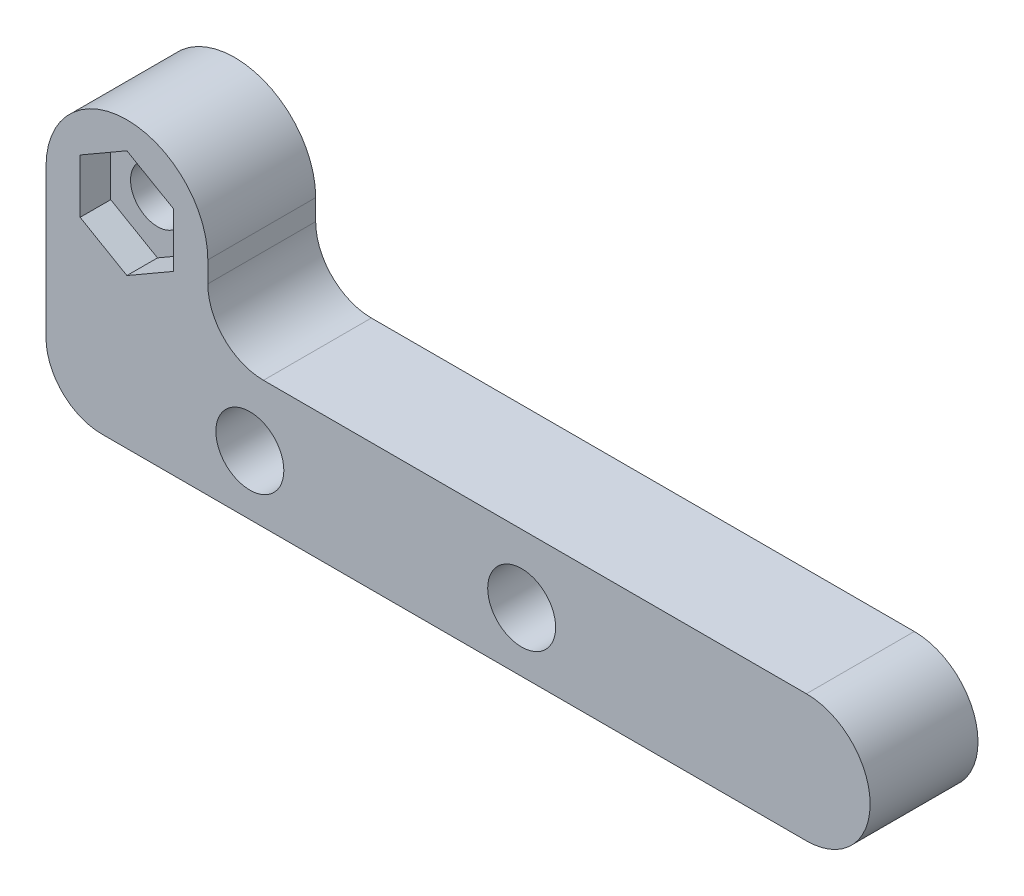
ISO-10303-21;
HEADER;
FILE_DESCRIPTION(('STEP AP214'),'2;1');
FILE_NAME('part.step','',(''),(''),'','','');
FILE_SCHEMA(('AUTOMOTIVE_DESIGN { 1 0 10303 214 1 1 1 1 }'));
ENDSEC;
DATA;
#1=APPLICATION_CONTEXT('core data for automotive mechanical design processes');
#2=APPLICATION_PROTOCOL_DEFINITION('international standard','automotive_design',2000,#1);
#3=PRODUCT_CONTEXT('',#1,'mechanical');
#4=PRODUCT('Part','Part','',(#3));
#5=PRODUCT_RELATED_PRODUCT_CATEGORY('part','',(#4));
#6=PRODUCT_DEFINITION_FORMATION('','',#4);
#7=PRODUCT_DEFINITION_CONTEXT('part definition',#1,'design');
#8=PRODUCT_DEFINITION('design','',#6,#7);
#9=PRODUCT_DEFINITION_SHAPE('','',#8);
#10=(LENGTH_UNIT() NAMED_UNIT(*) SI_UNIT(.MILLI.,.METRE.));
#11=(NAMED_UNIT(*) PLANE_ANGLE_UNIT() SI_UNIT($,.RADIAN.));
#12=(NAMED_UNIT(*) SI_UNIT($,.STERADIAN.) SOLID_ANGLE_UNIT());
#13=UNCERTAINTY_MEASURE_WITH_UNIT(LENGTH_MEASURE(1.E-05),#10,'distance_accuracy_value','');
#14=(GEOMETRIC_REPRESENTATION_CONTEXT(3) GLOBAL_UNCERTAINTY_ASSIGNED_CONTEXT((#13)) GLOBAL_UNIT_ASSIGNED_CONTEXT((#10,
#11,#12)) REPRESENTATION_CONTEXT('',''));
#15=CARTESIAN_POINT('',(0.,0.,0.));
#16=DIRECTION('',(0.,0.,1.));
#17=DIRECTION('',(1.,0.,0.));
#18=AXIS2_PLACEMENT_3D('',#15,#16,#17);
#19=CARTESIAN_POINT('',(0.,0.,6.35));
#20=DIRECTION('',(0.,0.,1.));
#21=DIRECTION('',(1.,0.,0.));
#22=AXIS2_PLACEMENT_3D('',#19,#20,#21);
#23=PLANE('',#22);
#24=CARTESIAN_POINT('',(-3.78399987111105,-8.5,6.35));
#25=DIRECTION('',(0.,0.,1.));
#26=DIRECTION('',(1.,0.,0.));
#27=AXIS2_PLACEMENT_3D('',#24,#25,#26);
#28=CIRCLE('',#27,2.);
#29=CARTESIAN_POINT('',(-1.78399987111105,-8.5,6.35));
#30=VERTEX_POINT('',#29);
#31=EDGE_CURVE('E565',#30,#30,#28,.F.);
#32=ORIENTED_EDGE('',*,*,#31,.T.);
#33=EDGE_LOOP('',(#32));
#34=FACE_BOUND('',#33,.T.);
#35=DIRECTION('',(0.,-1.,0.));
#36=VECTOR('',#35,1.);
#37=CARTESIAN_POINT('',(-13.7754606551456,1.59,6.35));
#38=LINE('',#37,#36);
#39=CARTESIAN_POINT('',(-13.7754606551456,1.59,6.35));
#40=VERTEX_POINT('',#39);
#41=CARTESIAN_POINT('',(-13.7754606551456,-1.59,6.35));
#42=VERTEX_POINT('',#41);
#43=EDGE_CURVE('E59',#40,#42,#38,.T.);
#44=ORIENTED_EDGE('',*,*,#43,.F.);
#45=DIRECTION('',(-0.866025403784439,-0.5,0.));
#46=VECTOR('',#45,1.);
#47=CARTESIAN_POINT('',(-11.021499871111,3.18,6.35));
#48=LINE('',#47,#46);
#49=CARTESIAN_POINT('',(-11.021499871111,3.18,6.35));
#50=VERTEX_POINT('',#49);
#51=EDGE_CURVE('E178',#50,#40,#48,.T.);
#52=ORIENTED_EDGE('',*,*,#51,.F.);
#53=DIRECTION('',(-0.866025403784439,0.5,0.));
#54=VECTOR('',#53,1.);
#55=CARTESIAN_POINT('',(-8.26753908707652,1.59,6.35));
#56=LINE('',#55,#54);
#57=CARTESIAN_POINT('',(-8.26753908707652,1.59,6.35));
#58=VERTEX_POINT('',#57);
#59=EDGE_CURVE('E181',#58,#50,#56,.T.);
#60=ORIENTED_EDGE('',*,*,#59,.F.);
#61=DIRECTION('',(0.,1.,0.));
#62=VECTOR('',#61,1.);
#63=CARTESIAN_POINT('',(-8.26753908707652,-1.59,6.35));
#64=LINE('',#63,#62);
#65=CARTESIAN_POINT('',(-8.26753908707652,-1.59,6.35));
#66=VERTEX_POINT('',#65);
#67=EDGE_CURVE('E200',#66,#58,#64,.T.);
#68=ORIENTED_EDGE('',*,*,#67,.F.);
#69=DIRECTION('',(0.866025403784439,0.5,0.));
#70=VECTOR('',#69,1.);
#71=CARTESIAN_POINT('',(-11.021499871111,-3.18,6.35));
#72=LINE('',#71,#70);
#73=CARTESIAN_POINT('',(-11.021499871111,-3.18,6.35));
#74=VERTEX_POINT('',#73);
#75=EDGE_CURVE('E197',#74,#66,#72,.T.);
#76=ORIENTED_EDGE('',*,*,#75,.F.);
#77=DIRECTION('',(0.866025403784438,-0.5,0.));
#78=VECTOR('',#77,1.);
#79=CARTESIAN_POINT('',(-13.7754606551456,-1.59,6.35));
#80=LINE('',#79,#78);
#81=EDGE_CURVE('E195',#42,#74,#80,.T.);
#82=ORIENTED_EDGE('',*,*,#81,.F.);
#83=EDGE_LOOP('',(#44,#52,#60,#68,#76,#82));
#84=FACE_BOUND('',#83,.T.);
#85=DIRECTION('',(0.,-1.,0.));
#86=VECTOR('',#85,1.);
#87=CARTESIAN_POINT('',(-15.7839998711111,0.,6.35));
#88=LINE('',#87,#86);
#89=CARTESIAN_POINT('',(-15.7839998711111,0.,6.35));
#90=VERTEX_POINT('',#89);
#91=CARTESIAN_POINT('',(-15.783999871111,-8.7234,6.35));
#92=VERTEX_POINT('',#91);
#93=EDGE_CURVE('E232',#90,#92,#88,.T.);
#94=ORIENTED_EDGE('',*,*,#93,.T.);
#95=CARTESIAN_POINT('',(-12.507399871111,-8.7234,6.35));
#96=DIRECTION('',(0.,0.,1.));
#97=DIRECTION('',(1.,0.,0.));
#98=AXIS2_PLACEMENT_3D('',#95,#96,#97);
#99=CIRCLE('',#98,3.2766);
#100=CARTESIAN_POINT('',(-12.507399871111,-12.,6.35));
#101=VERTEX_POINT('',#100);
#102=EDGE_CURVE('E381',#92,#101,#99,.T.);
#103=ORIENTED_EDGE('',*,*,#102,.T.);
#104=DIRECTION('',(-1.,0.,0.));
#105=VECTOR('',#104,1.);
#106=CARTESIAN_POINT('',(0.,-12.,6.35));
#107=LINE('',#106,#105);
#108=CARTESIAN_POINT('',(28.978500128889,-12.,6.35));
#109=VERTEX_POINT('',#108);
#110=EDGE_CURVE('E219',#109,#101,#107,.T.);
#111=ORIENTED_EDGE('',*,*,#110,.F.);
#112=CARTESIAN_POINT('',(28.978500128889,-8.25,6.35));
#113=DIRECTION('',(0.,0.,1.));
#114=DIRECTION('',(1.,0.,0.));
#115=AXIS2_PLACEMENT_3D('',#112,#113,#114);
#116=CIRCLE('',#115,3.74999999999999);
#117=CARTESIAN_POINT('',(28.978500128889,-4.5,6.35));
#118=VERTEX_POINT('',#117);
#119=EDGE_CURVE('E222',#109,#118,#116,.T.);
#120=ORIENTED_EDGE('',*,*,#119,.T.);
#121=DIRECTION('',(1.,0.,0.));
#122=VECTOR('',#121,1.);
#123=CARTESIAN_POINT('',(0.,-4.5,6.35));
#124=LINE('',#123,#122);
#125=CARTESIAN_POINT('',(-2.98239987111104,-4.5,6.35));
#126=VERTEX_POINT('',#125);
#127=EDGE_CURVE('E226',#126,#118,#124,.T.);
#128=ORIENTED_EDGE('',*,*,#127,.F.);
#129=CARTESIAN_POINT('',(-2.98239987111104,-1.2234,6.35));
#130=DIRECTION('',(0.,0.,1.));
#131=DIRECTION('',(1.,0.,0.));
#132=AXIS2_PLACEMENT_3D('',#129,#130,#131);
#133=CIRCLE('',#132,3.2766);
#134=CARTESIAN_POINT('',(-6.25899987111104,-1.2234,6.35));
#135=VERTEX_POINT('',#134);
#136=EDGE_CURVE('E11',#126,#135,#133,.F.);
#137=ORIENTED_EDGE('',*,*,#136,.T.);
#138=DIRECTION('',(0.,-1.,0.));
#139=VECTOR('',#138,1.);
#140=CARTESIAN_POINT('',(-6.25899987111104,0.,6.35));
#141=LINE('',#140,#139);
#142=CARTESIAN_POINT('',(-6.25899987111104,0.,6.35));
#143=VERTEX_POINT('',#142);
#144=EDGE_CURVE('E228',#143,#135,#141,.T.);
#145=ORIENTED_EDGE('',*,*,#144,.F.);
#146=CARTESIAN_POINT('',(-11.021499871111,0.,6.35));
#147=DIRECTION('',(0.,0.,1.));
#148=DIRECTION('',(1.,0.,0.));
#149=AXIS2_PLACEMENT_3D('',#146,#147,#148);
#150=CIRCLE('',#149,4.7625);
#151=EDGE_CURVE('E230',#143,#90,#150,.T.);
#152=ORIENTED_EDGE('',*,*,#151,.T.);
#153=EDGE_LOOP('',(#94,#103,#111,#120,#128,#137,#145,#152));
#154=FACE_BOUND('',#153,.T.);
#155=CARTESIAN_POINT('',(12.2160001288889,-8.5,6.35));
#156=DIRECTION('',(0.,0.,1.));
#157=DIRECTION('',(1.,0.,0.));
#158=AXIS2_PLACEMENT_3D('',#155,#156,#157);
#159=CIRCLE('',#158,2.);
#160=CARTESIAN_POINT('',(14.2160001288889,-8.5,6.35));
#161=VERTEX_POINT('',#160);
#162=EDGE_CURVE('E184',#161,#161,#159,.T.);
#163=ORIENTED_EDGE('',*,*,#162,.F.);
#164=EDGE_LOOP('',(#163));
#165=FACE_BOUND('',#164,.T.);
#166=ADVANCED_FACE('F43',(#34,#84,#154,#165),#23,.T.);
#167=CARTESIAN_POINT('',(0.,0.,0.));
#168=DIRECTION('',(0.,0.,1.));
#169=DIRECTION('',(1.,0.,0.));
#170=AXIS2_PLACEMENT_3D('',#167,#168,#169);
#171=PLANE('',#170);
#172=CARTESIAN_POINT('',(-11.021499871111,0.,0.));
#173=DIRECTION('',(0.,0.,1.));
#174=DIRECTION('',(1.,0.,0.));
#175=AXIS2_PLACEMENT_3D('',#172,#173,#174);
#176=CIRCLE('',#175,1.5875);
#177=CARTESIAN_POINT('',(-9.43399987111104,0.,0.));
#178=VERTEX_POINT('',#177);
#179=EDGE_CURVE('E223',#178,#178,#176,.T.);
#180=ORIENTED_EDGE('',*,*,#179,.T.);
#181=EDGE_LOOP('',(#180));
#182=FACE_BOUND('',#181,.T.);
#183=DIRECTION('',(-1.,0.,0.));
#184=VECTOR('',#183,1.);
#185=CARTESIAN_POINT('',(0.,-12.,0.));
#186=LINE('',#185,#184);
#187=CARTESIAN_POINT('',(28.978500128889,-12.,0.));
#188=VERTEX_POINT('',#187);
#189=CARTESIAN_POINT('',(-12.507399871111,-12.,0.));
#190=VERTEX_POINT('',#189);
#191=EDGE_CURVE('E217',#188,#190,#186,.T.);
#192=ORIENTED_EDGE('',*,*,#191,.T.);
#193=CARTESIAN_POINT('',(-12.507399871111,-8.7234,0.));
#194=DIRECTION('',(0.,0.,1.));
#195=DIRECTION('',(1.,0.,0.));
#196=AXIS2_PLACEMENT_3D('',#193,#194,#195);
#197=CIRCLE('',#196,3.2766);
#198=CARTESIAN_POINT('',(-15.783999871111,-8.7234,0.));
#199=VERTEX_POINT('',#198);
#200=EDGE_CURVE('E376',#190,#199,#197,.F.);
#201=ORIENTED_EDGE('',*,*,#200,.T.);
#202=DIRECTION('',(0.,-1.,0.));
#203=VECTOR('',#202,1.);
#204=CARTESIAN_POINT('',(-15.7839998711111,0.,0.));
#205=LINE('',#204,#203);
#206=CARTESIAN_POINT('',(-15.7839998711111,0.,0.));
#207=VERTEX_POINT('',#206);
#208=EDGE_CURVE('E249',#207,#199,#205,.T.);
#209=ORIENTED_EDGE('',*,*,#208,.F.);
#210=CARTESIAN_POINT('',(-11.021499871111,0.,0.));
#211=DIRECTION('',(0.,0.,1.));
#212=DIRECTION('',(1.,0.,0.));
#213=AXIS2_PLACEMENT_3D('',#210,#211,#212);
#214=CIRCLE('',#213,4.7625);
#215=CARTESIAN_POINT('',(-6.25899987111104,0.,0.));
#216=VERTEX_POINT('',#215);
#217=EDGE_CURVE('E246',#216,#207,#214,.T.);
#218=ORIENTED_EDGE('',*,*,#217,.F.);
#219=DIRECTION('',(0.,-1.,0.));
#220=VECTOR('',#219,1.);
#221=CARTESIAN_POINT('',(-6.25899987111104,0.,0.));
#222=LINE('',#221,#220);
#223=CARTESIAN_POINT('',(-6.25899987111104,-1.2234,0.));
#224=VERTEX_POINT('',#223);
#225=EDGE_CURVE('E243',#216,#224,#222,.T.);
#226=ORIENTED_EDGE('',*,*,#225,.T.);
#227=CARTESIAN_POINT('',(-2.98239987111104,-1.2234,0.));
#228=DIRECTION('',(0.,0.,1.));
#229=DIRECTION('',(1.,0.,0.));
#230=AXIS2_PLACEMENT_3D('',#227,#228,#229);
#231=CIRCLE('',#230,3.2766);
#232=CARTESIAN_POINT('',(-2.98239987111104,-4.5,0.));
#233=VERTEX_POINT('',#232);
#234=EDGE_CURVE('E52',#224,#233,#231,.T.);
#235=ORIENTED_EDGE('',*,*,#234,.T.);
#236=DIRECTION('',(1.,0.,0.));
#237=VECTOR('',#236,1.);
#238=CARTESIAN_POINT('',(0.,-4.5,0.));
#239=LINE('',#238,#237);
#240=CARTESIAN_POINT('',(28.978500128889,-4.5,0.));
#241=VERTEX_POINT('',#240);
#242=EDGE_CURVE('E241',#233,#241,#239,.T.);
#243=ORIENTED_EDGE('',*,*,#242,.T.);
#244=CARTESIAN_POINT('',(28.978500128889,-8.25,0.));
#245=DIRECTION('',(0.,0.,1.));
#246=DIRECTION('',(1.,0.,0.));
#247=AXIS2_PLACEMENT_3D('',#244,#245,#246);
#248=CIRCLE('',#247,3.74999999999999);
#249=EDGE_CURVE('E238',#188,#241,#248,.T.);
#250=ORIENTED_EDGE('',*,*,#249,.F.);
#251=EDGE_LOOP('',(#192,#201,#209,#218,#226,#235,#243,#250));
#252=FACE_BOUND('',#251,.T.);
#253=CARTESIAN_POINT('',(-3.78399987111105,-8.5,0.));
#254=DIRECTION('',(0.,0.,1.));
#255=DIRECTION('',(1.,0.,0.));
#256=AXIS2_PLACEMENT_3D('',#253,#254,#255);
#257=CIRCLE('',#256,2.);
#258=CARTESIAN_POINT('',(-1.78399987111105,-8.5,0.));
#259=VERTEX_POINT('',#258);
#260=EDGE_CURVE('E566',#259,#259,#257,.T.);
#261=ORIENTED_EDGE('',*,*,#260,.T.);
#262=EDGE_LOOP('',(#261));
#263=FACE_BOUND('',#262,.T.);
#264=CARTESIAN_POINT('',(12.2160001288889,-8.5,0.));
#265=DIRECTION('',(0.,0.,-1.));
#266=DIRECTION('',(-1.,0.,0.));
#267=AXIS2_PLACEMENT_3D('',#264,#265,#266);
#268=CIRCLE('',#267,2.);
#269=CARTESIAN_POINT('',(10.2160001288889,-8.5,0.));
#270=VERTEX_POINT('',#269);
#271=EDGE_CURVE('E563',#270,#270,#268,.T.);
#272=ORIENTED_EDGE('',*,*,#271,.F.);
#273=EDGE_LOOP('',(#272));
#274=FACE_BOUND('',#273,.T.);
#275=ADVANCED_FACE('F390',(#182,#252,#263,#274),#171,.F.);
#276=CARTESIAN_POINT('',(-11.021499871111,0.,6.35));
#277=DIRECTION('',(0.,0.,-1.));
#278=DIRECTION('',(-1.,0.,0.));
#279=AXIS2_PLACEMENT_3D('',#276,#277,#278);
#280=CYLINDRICAL_SURFACE('',#279,1.5875);
#281=ORIENTED_EDGE('',*,*,#179,.F.);
#282=EDGE_LOOP('',(#281));
#283=FACE_BOUND('',#282,.T.);
#284=CARTESIAN_POINT('',(-11.021499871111,0.,4.55));
#285=DIRECTION('',(0.,0.,1.));
#286=DIRECTION('',(1.,0.,0.));
#287=AXIS2_PLACEMENT_3D('',#284,#285,#286);
#288=CIRCLE('',#287,1.5875);
#289=CARTESIAN_POINT('',(-9.43399987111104,0.,4.55));
#290=VERTEX_POINT('',#289);
#291=EDGE_CURVE('E47',#290,#290,#288,.T.);
#292=ORIENTED_EDGE('',*,*,#291,.T.);
#293=EDGE_LOOP('',(#292));
#294=FACE_BOUND('',#293,.T.);
#295=ADVANCED_FACE('F305',(#283,#294),#280,.F.);
#296=CARTESIAN_POINT('',(0.,-12.,6.35));
#297=DIRECTION('',(0.,-1.,0.));
#298=DIRECTION('',(1.,0.,0.));
#299=AXIS2_PLACEMENT_3D('',#296,#297,#298);
#300=PLANE('',#299);
#301=ORIENTED_EDGE('',*,*,#110,.T.);
#302=DIRECTION('',(0.,0.,-1.));
#303=VECTOR('',#302,1.);
#304=CARTESIAN_POINT('',(-12.507399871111,-12.,0.));
#305=LINE('',#304,#303);
#306=EDGE_CURVE('E368',#101,#190,#305,.T.);
#307=ORIENTED_EDGE('',*,*,#306,.T.);
#308=ORIENTED_EDGE('',*,*,#191,.F.);
#309=DIRECTION('',(0.,0.,-1.));
#310=VECTOR('',#309,1.);
#311=CARTESIAN_POINT('',(28.978500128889,-12.,6.35));
#312=LINE('',#311,#310);
#313=EDGE_CURVE('E412',#109,#188,#312,.T.);
#314=ORIENTED_EDGE('',*,*,#313,.F.);
#315=EDGE_LOOP('',(#301,#307,#308,#314));
#316=FACE_BOUND('',#315,.T.);
#317=ADVANCED_FACE('F301',(#316),#300,.T.);
#318=CARTESIAN_POINT('',(28.978500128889,-8.25,6.35));
#319=DIRECTION('',(0.,0.,-1.));
#320=DIRECTION('',(-1.,0.,0.));
#321=AXIS2_PLACEMENT_3D('',#318,#319,#320);
#322=CYLINDRICAL_SURFACE('',#321,3.74999999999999);
#323=ORIENTED_EDGE('',*,*,#249,.T.);
#324=DIRECTION('',(0.,0.,-1.));
#325=VECTOR('',#324,1.);
#326=CARTESIAN_POINT('',(28.978500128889,-4.5,6.35));
#327=LINE('',#326,#325);
#328=EDGE_CURVE('E400',#118,#241,#327,.T.);
#329=ORIENTED_EDGE('',*,*,#328,.F.);
#330=ORIENTED_EDGE('',*,*,#119,.F.);
#331=ORIENTED_EDGE('',*,*,#313,.T.);
#332=EDGE_LOOP('',(#323,#329,#330,#331));
#333=FACE_BOUND('',#332,.T.);
#334=ADVANCED_FACE('F297',(#333),#322,.T.);
#335=CARTESIAN_POINT('',(0.,-4.5,6.35));
#336=DIRECTION('',(0.,1.,0.));
#337=DIRECTION('',(-1.,0.,0.));
#338=AXIS2_PLACEMENT_3D('',#335,#336,#337);
#339=PLANE('',#338);
#340=ORIENTED_EDGE('',*,*,#242,.F.);
#341=DIRECTION('',(0.,0.,-1.));
#342=VECTOR('',#341,1.);
#343=CARTESIAN_POINT('',(-2.98239987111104,-4.5,6.35));
#344=LINE('',#343,#342);
#345=EDGE_CURVE('E386',#233,#126,#344,.F.);
#346=ORIENTED_EDGE('',*,*,#345,.T.);
#347=ORIENTED_EDGE('',*,*,#127,.T.);
#348=ORIENTED_EDGE('',*,*,#328,.T.);
#349=EDGE_LOOP('',(#340,#346,#347,#348));
#350=FACE_BOUND('',#349,.T.);
#351=ADVANCED_FACE('F293',(#350),#339,.T.);
#352=CARTESIAN_POINT('',(-6.25899987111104,0.,6.35));
#353=DIRECTION('',(1.,0.,0.));
#354=DIRECTION('',(0.,1.,0.));
#355=AXIS2_PLACEMENT_3D('',#352,#353,#354);
#356=PLANE('',#355);
#357=ORIENTED_EDGE('',*,*,#144,.T.);
#358=DIRECTION('',(0.,0.,-1.));
#359=VECTOR('',#358,1.);
#360=CARTESIAN_POINT('',(-6.25899987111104,-1.2234,0.));
#361=LINE('',#360,#359);
#362=EDGE_CURVE('E383',#135,#224,#361,.T.);
#363=ORIENTED_EDGE('',*,*,#362,.T.);
#364=ORIENTED_EDGE('',*,*,#225,.F.);
#365=DIRECTION('',(0.,0.,-1.));
#366=VECTOR('',#365,1.);
#367=CARTESIAN_POINT('',(-6.25899987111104,0.,6.35));
#368=LINE('',#367,#366);
#369=EDGE_CURVE('E256',#143,#216,#368,.T.);
#370=ORIENTED_EDGE('',*,*,#369,.F.);
#371=EDGE_LOOP('',(#357,#363,#364,#370));
#372=FACE_BOUND('',#371,.T.);
#373=ADVANCED_FACE('F289',(#372),#356,.T.);
#374=CARTESIAN_POINT('',(-11.021499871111,0.,6.35));
#375=DIRECTION('',(0.,0.,-1.));
#376=DIRECTION('',(-1.,0.,0.));
#377=AXIS2_PLACEMENT_3D('',#374,#375,#376);
#378=CYLINDRICAL_SURFACE('',#377,4.7625);
#379=DIRECTION('',(0.,0.,-1.));
#380=VECTOR('',#379,1.);
#381=CARTESIAN_POINT('',(-15.7839998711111,0.,6.35));
#382=LINE('',#381,#380);
#383=CARTESIAN_POINT('',(-15.7839998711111,0.,1.71875000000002));
#384=VERTEX_POINT('',#383);
#385=EDGE_CURVE('E235',#384,#207,#382,.T.);
#386=ORIENTED_EDGE('',*,*,#385,.F.);
#387=CARTESIAN_POINT('',(-15.783999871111,0.,6.21874999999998));
#388=CARTESIAN_POINT('',(-15.7839994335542,0.0848417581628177,6.21874780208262));
#389=CARTESIAN_POINT('',(-15.7817347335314,0.169018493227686,6.21491617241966));
#390=CARTESIAN_POINT('',(-15.772862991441,0.336084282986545,6.19981840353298));
#391=CARTESIAN_POINT('',(-15.766250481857,0.418991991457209,6.18854437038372));
#392=CARTESIAN_POINT('',(-15.753201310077,0.542340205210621,6.16609126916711));
#393=CARTESIAN_POINT('',(-15.7483129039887,0.583380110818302,6.15765224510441));
#394=CARTESIAN_POINT('',(-15.7375510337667,0.66479487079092,6.1389777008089));
#395=CARTESIAN_POINT('',(-15.7317126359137,0.704920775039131,6.1288029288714));
#396=CARTESIAN_POINT('',(-15.7191609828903,0.784217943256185,6.10679521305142));
#397=CARTESIAN_POINT('',(-15.7124514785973,0.823361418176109,6.09496879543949));
#398=CARTESIAN_POINT('',(-15.6982233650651,0.900671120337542,6.06971147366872));
#399=CARTESIAN_POINT('',(-15.6907046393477,0.938837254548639,6.05628043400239));
#400=CARTESIAN_POINT('',(-15.6670170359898,1.05190741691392,6.01362009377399));
#401=CARTESIAN_POINT('',(-15.6497164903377,1.12538597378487,5.98202922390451));
#402=CARTESIAN_POINT('',(-15.612512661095,1.26865540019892,5.91259642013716));
#403=CARTESIAN_POINT('',(-15.5926213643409,1.33840292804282,5.87478111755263));
#404=CARTESIAN_POINT('',(-15.5505880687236,1.47439080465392,5.79263277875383));
#405=CARTESIAN_POINT('',(-15.5287918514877,1.53951187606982,5.74896555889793));
#406=CARTESIAN_POINT('',(-15.484311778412,1.66405820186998,5.656812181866));
#407=CARTESIAN_POINT('',(-15.4616072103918,1.72354285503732,5.60828877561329));
#408=CARTESIAN_POINT('',(-15.4158338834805,1.83711312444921,5.50633101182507));
#409=CARTESIAN_POINT('',(-15.3927556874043,1.89121250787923,5.45287596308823));
#410=CARTESIAN_POINT('',(-15.3583267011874,1.96828259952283,5.36891107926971));
#411=CARTESIAN_POINT('',(-15.3468673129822,1.99331986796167,5.34024795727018));
#412=CARTESIAN_POINT('',(-15.3241146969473,2.04196785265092,5.2816680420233));
#413=CARTESIAN_POINT('',(-15.3128917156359,2.0654299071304,5.25193241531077));
#414=CARTESIAN_POINT('',(-15.2798104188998,2.13324068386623,5.16140023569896));
#415=CARTESIAN_POINT('',(-15.2584902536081,2.17513501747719,5.09917754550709));
#416=CARTESIAN_POINT('',(-15.2180286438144,2.25220952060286,4.9710072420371));
#417=CARTESIAN_POINT('',(-15.1988717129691,2.28742009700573,4.90501128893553));
#418=CARTESIAN_POINT('',(-15.1722996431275,2.33508030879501,4.80305948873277));
#419=CARTESIAN_POINT('',(-15.1637929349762,2.35012336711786,4.76851911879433));
#420=CARTESIAN_POINT('',(-15.1476263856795,2.37839253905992,4.69851244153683));
#421=CARTESIAN_POINT('',(-15.1400266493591,2.3915144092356,4.6633047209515));
#422=CARTESIAN_POINT('',(-15.1258317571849,2.41579464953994,4.59237312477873));
#423=CARTESIAN_POINT('',(-15.1192406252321,2.42694600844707,4.55666662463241));
#424=CARTESIAN_POINT('',(-15.1071323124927,2.44727476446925,4.484766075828));
#425=CARTESIAN_POINT('',(-15.1016151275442,2.45645213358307,4.44857202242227));
#426=CARTESIAN_POINT('',(-15.0867660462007,2.48100450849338,4.33924486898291));
#427=CARTESIAN_POINT('',(-15.0791399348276,2.4934032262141,4.26535513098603));
#428=CARTESIAN_POINT('',(-15.0727400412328,2.50377014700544,4.17171748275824));
#429=CARTESIAN_POINT('',(-15.0716185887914,2.5055833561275,4.15291290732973));
#430=CARTESIAN_POINT('',(-15.0696961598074,2.50868818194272,4.11519657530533));
#431=CARTESIAN_POINT('',(-15.0688949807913,2.50998018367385,4.09624006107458));
#432=CARTESIAN_POINT('',(-15.0669956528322,2.51304116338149,4.03951911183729));
#433=CARTESIAN_POINT('',(-15.0663950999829,2.51400652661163,4.00187828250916));
#434=CARTESIAN_POINT('',(-15.0664966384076,2.51384316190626,3.92685140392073));
#435=CARTESIAN_POINT('',(-15.0671987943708,2.51271424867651,3.88947941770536));
#436=CARTESIAN_POINT('',(-15.0698749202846,2.50840032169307,3.81501274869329));
#437=CARTESIAN_POINT('',(-15.0718488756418,2.5052151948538,3.77791807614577));
#438=CARTESIAN_POINT('',(-15.0796281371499,2.49260898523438,3.66704375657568));
#439=CARTESIAN_POINT('',(-15.0872987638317,2.48013245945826,3.59363946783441));
#440=CARTESIAN_POINT('',(-15.1022764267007,2.4553538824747,3.48444008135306));
#441=CARTESIAN_POINT('',(-15.1078618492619,2.44605704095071,3.44812087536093));
#442=CARTESIAN_POINT('',(-15.1201313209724,2.42544248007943,3.37586591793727));
#443=CARTESIAN_POINT('',(-15.1268613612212,2.41404559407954,3.33971310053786));
#444=CARTESIAN_POINT('',(-15.1412080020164,2.3894796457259,3.26860538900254));
#445=CARTESIAN_POINT('',(-15.1488373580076,2.37628995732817,3.23354226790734));
#446=CARTESIAN_POINT('',(-15.1649080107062,2.34815623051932,3.16438511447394));
#447=CARTESIAN_POINT('',(-15.1733498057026,2.33321143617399,3.13028541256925));
#448=CARTESIAN_POINT('',(-15.1997568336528,2.28580050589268,3.02936594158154));
#449=CARTESIAN_POINT('',(-15.2188025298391,2.25076410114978,2.96392278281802));
#450=CARTESIAN_POINT('',(-15.2591021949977,2.17393961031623,2.83650672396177));
#451=CARTESIAN_POINT('',(-15.2803633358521,2.13213659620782,2.77452349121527));
#452=CARTESIAN_POINT('',(-15.3134317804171,2.06430756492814,2.68412253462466));
#453=CARTESIAN_POINT('',(-15.3246747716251,2.04078725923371,2.65436340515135));
#454=CARTESIAN_POINT('',(-15.3474037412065,1.99215516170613,2.59589878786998));
#455=CARTESIAN_POINT('',(-15.3588265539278,1.96717918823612,2.56735227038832));
#456=CARTESIAN_POINT('',(-15.3817491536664,1.91583476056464,2.51148489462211));
#457=CARTESIAN_POINT('',(-15.3932422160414,1.88948087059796,2.48418135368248));
#458=CARTESIAN_POINT('',(-15.4162160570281,1.83541239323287,2.43080503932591));
#459=CARTESIAN_POINT('',(-15.4276969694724,1.80769775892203,2.40473235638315));
#460=CARTESIAN_POINT('',(-15.46201237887,1.72249921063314,2.32833384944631));
#461=CARTESIAN_POINT('',(-15.4847293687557,1.66293678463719,2.27980467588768));
#462=CARTESIAN_POINT('',(-15.5181016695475,1.56942022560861,2.21069152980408));
#463=CARTESIAN_POINT('',(-15.529125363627,1.53749702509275,2.18823650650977));
#464=CARTESIAN_POINT('',(-15.5508568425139,1.47224930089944,2.14459377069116));
#465=CARTESIAN_POINT('',(-15.5616022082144,1.43879688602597,2.12333409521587));
#466=CARTESIAN_POINT('',(-15.5825078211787,1.37108149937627,2.08249221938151));
#467=CARTESIAN_POINT('',(-15.5927070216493,1.33670681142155,2.06283055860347));
#468=CARTESIAN_POINT('',(-15.6125217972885,1.2669796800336,2.02505317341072));
#469=CARTESIAN_POINT('',(-15.6221410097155,1.23161713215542,2.00693027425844));
#470=CARTESIAN_POINT('',(-15.6500512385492,1.12401504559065,1.95485447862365));
#471=CARTESIAN_POINT('',(-15.6673990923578,1.05024954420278,1.92318378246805));
#472=CARTESIAN_POINT('',(-15.6911792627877,0.936485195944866,1.88036899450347));
#473=CARTESIAN_POINT('',(-15.6987386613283,0.898003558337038,1.86686963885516));
#474=CARTESIAN_POINT('',(-15.7130381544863,0.820030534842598,1.84149424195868));
#475=CARTESIAN_POINT('',(-15.7198049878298,0.780367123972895,1.8295714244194));
#476=CARTESIAN_POINT('',(-15.7323768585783,0.70048301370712,1.80753707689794));
#477=CARTESIAN_POINT('',(-15.7381682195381,0.660378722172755,1.79744863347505));
#478=CARTESIAN_POINT('',(-15.7487584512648,0.579729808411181,1.77907759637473));
#479=CARTESIAN_POINT('',(-15.7535545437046,0.539204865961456,1.7707999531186));
#480=CARTESIAN_POINT('',(-15.7664130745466,0.417028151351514,1.7486779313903));
#481=CARTESIAN_POINT('',(-15.7729472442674,0.334775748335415,1.73753800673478));
#482=CARTESIAN_POINT('',(-15.7817402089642,0.168634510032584,1.72257472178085));
#483=CARTESIAN_POINT('',(-15.7839993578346,0.0847455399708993,1.71875229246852));
#484=CARTESIAN_POINT('',(-15.783999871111,0.,1.71875000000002));
#485=B_SPLINE_CURVE_WITH_KNOTS('',3,(#387,#388,#389,#390,#391,#392,#393,#394,#395,#396,#397,
#398,#399,#400,#401,#402,#403,#404,#405,#406,#407,#408,#409,#410,#411,#412,#413,#414,#415,#416,
#417,#418,#419,#420,#421,#422,#423,#424,#425,#426,#427,#428,#429,#430,#431,#432,#433,#434,#435,
#436,#437,#438,#439,#440,#441,#442,#443,#444,#445,#446,#447,#448,#449,#450,#451,#452,#453,#454,
#455,#456,#457,#458,#459,#460,#461,#462,#463,#464,#465,#466,#467,#468,#469,#470,#471,#472,#473,
#474,#475,#476,#477,#478,#479,#480,#481,#482,#483,#484),.UNSPECIFIED.,.F.,.F.,(4,2,2,2,2,2,2,2,
2,2,2,2,2,2,2,2,2,2,2,2,2,2,2,2,2,2,2,2,2,2,2,2,2,2,2,2,2,2,2,2,2,2,2,2,2,2,2,2,4),(0.,
0.000224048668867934,0.000448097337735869,0.000560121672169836,0.000672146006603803,
0.00078417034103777,0.000896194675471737,0.00112024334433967,0.00134429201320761,
0.00156834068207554,0.00179238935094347,0.00201643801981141,0.00212846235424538,
0.00224048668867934,0.00246453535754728,0.00268858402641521,0.00280060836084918,
0.00291263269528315,0.00302465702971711,0.00313668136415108,0.00336073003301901,
0.003416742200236,0.00347275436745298,0.00358477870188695,0.00369680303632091,
0.00380882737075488,0.00403287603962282,0.00414490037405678,0.00425692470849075,
0.00436894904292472,0.00448097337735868,0.00470502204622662,0.00492907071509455,
0.00504109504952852,0.00515311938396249,0.00526514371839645,0.00537716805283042,
0.00560121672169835,0.00571324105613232,0.00582526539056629,0.00593728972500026,
0.00604931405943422,0.00627336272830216,0.00638538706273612,0.00649741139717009,
0.00660943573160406,0.00672146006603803,0.00694550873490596,0.00716955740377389),.UNSPECIFIED.);
#486=CARTESIAN_POINT('',(-15.7839998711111,0.,6.21874999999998));
#487=VERTEX_POINT('',#486);
#488=EDGE_CURVE('E271',#384,#487,#485,.F.);
#489=ORIENTED_EDGE('',*,*,#488,.T.);
#490=EDGE_CURVE('E262',#90,#487,#382,.T.);
#491=ORIENTED_EDGE('',*,*,#490,.F.);
#492=ORIENTED_EDGE('',*,*,#151,.F.);
#493=ORIENTED_EDGE('',*,*,#369,.T.);
#494=ORIENTED_EDGE('',*,*,#217,.T.);
#495=EDGE_LOOP('',(#386,#489,#491,#492,#493,#494));
#496=FACE_BOUND('',#495,.T.);
#497=ADVANCED_FACE('F278',(#496),#378,.T.);
#498=CARTESIAN_POINT('',(-15.7839998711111,0.,6.35));
#499=DIRECTION('',(1.,0.,0.));
#500=DIRECTION('',(0.,1.,0.));
#501=AXIS2_PLACEMENT_3D('',#498,#499,#500);
#502=PLANE('',#501);
#503=ORIENTED_EDGE('',*,*,#208,.T.);
#504=DIRECTION('',(0.,0.,-1.));
#505=VECTOR('',#504,1.);
#506=CARTESIAN_POINT('',(-15.783999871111,-8.7234,6.35));
#507=LINE('',#506,#505);
#508=EDGE_CURVE('E379',#199,#92,#507,.F.);
#509=ORIENTED_EDGE('',*,*,#508,.T.);
#510=ORIENTED_EDGE('',*,*,#93,.F.);
#511=ORIENTED_EDGE('',*,*,#490,.T.);
#512=CARTESIAN_POINT('',(-15.7839998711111,0.,3.96875));
#513=DIRECTION('',(1.,0.,0.));
#514=DIRECTION('',(0.,1.,0.));
#515=AXIS2_PLACEMENT_3D('',#512,#513,#514);
#516=CIRCLE('',#515,2.24999999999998);
#517=EDGE_CURVE('E377',#487,#384,#516,.T.);
#518=ORIENTED_EDGE('',*,*,#517,.T.);
#519=ORIENTED_EDGE('',*,*,#385,.T.);
#520=EDGE_LOOP('',(#503,#509,#510,#511,#518,#519));
#521=FACE_BOUND('',#520,.T.);
#522=ADVANCED_FACE('F288',(#521),#502,.F.);
#523=CARTESIAN_POINT('',(-13.8789998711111,0.,3.96875));
#524=DIRECTION('',(-1.,0.,0.));
#525=DIRECTION('',(0.,0.,1.));
#526=AXIS2_PLACEMENT_3D('',#523,#524,#525);
#527=CYLINDRICAL_SURFACE('',#526,1.75);
#528=CARTESIAN_POINT('',(-15.2839998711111,0.,3.96875));
#529=DIRECTION('',(1.,0.,0.));
#530=DIRECTION('',(0.,0.,-1.));
#531=AXIS2_PLACEMENT_3D('',#528,#529,#530);
#532=CIRCLE('',#531,1.75);
#533=CARTESIAN_POINT('',(-15.2839998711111,0.,2.21875));
#534=VERTEX_POINT('',#533);
#535=CARTESIAN_POINT('',(-15.2839998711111,0.,5.71875));
#536=VERTEX_POINT('',#535);
#537=EDGE_CURVE('E415',#534,#536,#532,.F.);
#538=ORIENTED_EDGE('',*,*,#537,.T.);
#539=CARTESIAN_POINT('',(-15.2839998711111,0.,2.21875));
#540=CARTESIAN_POINT('',(-15.2839994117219,0.058993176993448,2.21875178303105));
#541=CARTESIAN_POINT('',(-15.2819774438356,0.117390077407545,2.2217247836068));
#542=CARTESIAN_POINT('',(-15.2741076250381,0.23304453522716,2.23336289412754));
#543=CARTESIAN_POINT('',(-15.2682594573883,0.290302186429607,2.24202727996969));
#544=CARTESIAN_POINT('',(-15.2567509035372,0.375352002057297,2.25923329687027));
#545=CARTESIAN_POINT('',(-15.2524583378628,0.403562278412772,2.26567146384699));
#546=CARTESIAN_POINT('',(-15.242979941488,0.459703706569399,2.27996004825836));
#547=CARTESIAN_POINT('',(-15.237796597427,0.487621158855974,2.28780661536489));
#548=CARTESIAN_POINT('',(-15.2265446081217,0.543230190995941,2.30494444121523));
#549=CARTESIAN_POINT('',(-15.2204882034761,0.570840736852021,2.31421774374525));
#550=CARTESIAN_POINT('',(-15.2076899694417,0.625119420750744,2.33395416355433));
#551=CARTESIAN_POINT('',(-15.2009242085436,0.651907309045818,2.34445366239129));
#552=CARTESIAN_POINT('',(-15.1796406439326,0.731101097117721,2.37775405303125));
#553=CARTESIAN_POINT('',(-15.1641140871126,0.782450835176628,2.40238681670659));
#554=CARTESIAN_POINT('',(-15.1391340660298,0.857354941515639,2.44289021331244));
#555=CARTESIAN_POINT('',(-15.1305247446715,0.88197156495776,2.45698580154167));
#556=CARTESIAN_POINT('',(-15.1127902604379,0.930510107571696,2.48636821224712));
#557=CARTESIAN_POINT('',(-15.1036618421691,0.954439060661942,2.50166061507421));
#558=CARTESIAN_POINT('',(-15.0849510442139,1.00157718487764,2.5334265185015));
#559=CARTESIAN_POINT('',(-15.0753338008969,1.02486412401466,2.54996182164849));
#560=CARTESIAN_POINT('',(-15.055883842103,1.07028445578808,2.58390617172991));
#561=CARTESIAN_POINT('',(-15.0460174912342,1.09250687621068,2.60137118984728));
#562=CARTESIAN_POINT('',(-15.0161488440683,1.15760574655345,2.65512585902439));
#563=CARTESIAN_POINT('',(-14.9958168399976,1.19906842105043,2.69287077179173));
#564=CARTESIAN_POINT('',(-14.9651040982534,1.25837694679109,2.75229183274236));
#565=CARTESIAN_POINT('',(-14.9548285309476,1.2776696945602,2.77257058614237));
#566=CARTESIAN_POINT('',(-14.9342666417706,1.31530791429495,2.81408549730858));
#567=CARTESIAN_POINT('',(-14.9239802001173,1.33365341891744,2.83532158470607));
#568=CARTESIAN_POINT('',(-14.9034641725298,1.36939536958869,2.8787739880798));
#569=CARTESIAN_POINT('',(-14.8932406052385,1.3867816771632,2.90097683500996));
#570=CARTESIAN_POINT('',(-14.8728978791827,1.42063551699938,2.94644931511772));
#571=CARTESIAN_POINT('',(-14.862835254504,1.43700850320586,2.9695953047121));
#572=CARTESIAN_POINT('',(-14.8332385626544,1.48422573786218,3.039907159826));
#573=CARTESIAN_POINT('',(-14.8142095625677,1.51332570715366,3.08811634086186));
#574=CARTESIAN_POINT('',(-14.7781408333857,1.56680487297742,3.18721771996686));
#575=CARTESIAN_POINT('',(-14.7610946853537,1.59119446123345,3.23811795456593));
#576=CARTESIAN_POINT('',(-14.7374600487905,1.62419822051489,3.31661087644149));
#577=CARTESIAN_POINT('',(-14.7299045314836,1.63460161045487,3.3431328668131));
#578=CARTESIAN_POINT('',(-14.7155210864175,1.65418609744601,3.39692176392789));
#579=CARTESIAN_POINT('',(-14.7086927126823,1.66336772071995,3.42419308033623));
#580=CARTESIAN_POINT('',(-14.6958522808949,1.68046860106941,3.47949907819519));
#581=CARTESIAN_POINT('',(-14.6898288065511,1.68840221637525,3.50761793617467));
#582=CARTESIAN_POINT('',(-14.6788474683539,1.70275245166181,3.56381623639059));
#583=CARTESIAN_POINT('',(-14.673848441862,1.7092241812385,3.59206450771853));
#584=CARTESIAN_POINT('',(-14.6604432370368,1.72647307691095,3.67699736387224));
#585=CARTESIAN_POINT('',(-14.6535779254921,1.73515825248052,3.7340895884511));
#586=CARTESIAN_POINT('',(-14.6466153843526,1.74393370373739,3.82032517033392));
#587=CARTESIAN_POINT('',(-14.6448486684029,1.74615093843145,3.84917658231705));
#588=CARTESIAN_POINT('',(-14.6424535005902,1.74915395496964,3.90709510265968));
#589=CARTESIAN_POINT('',(-14.6418250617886,1.74993981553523,3.9361622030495));
#590=CARTESIAN_POINT('',(-14.641734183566,1.75005353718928,3.99451644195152));
#591=CARTESIAN_POINT('',(-14.6422716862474,1.74938152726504,4.02379264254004));
#592=CARTESIAN_POINT('',(-14.6439716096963,1.74725071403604,4.06790893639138));
#593=CARTESIAN_POINT('',(-14.6446886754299,1.74635132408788,4.0826528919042));
#594=CARTESIAN_POINT('',(-14.6464092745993,1.74418998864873,4.11198781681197));
#595=CARTESIAN_POINT('',(-14.6474129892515,1.74292777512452,4.1266135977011));
#596=CARTESIAN_POINT('',(-14.6531409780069,1.73571114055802,4.19944287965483));
#597=CARTESIAN_POINT('',(-14.6599664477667,1.72708012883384,4.2569126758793));
#598=CARTESIAN_POINT('',(-14.6732565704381,1.70998869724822,4.34194490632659));
#599=CARTESIAN_POINT('',(-14.6781945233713,1.703600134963,4.37009583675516));
#600=CARTESIAN_POINT('',(-14.6890316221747,1.68944885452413,4.42601848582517));
#601=CARTESIAN_POINT('',(-14.6949307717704,1.68168615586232,4.45379020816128));
#602=CARTESIAN_POINT('',(-14.7076353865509,1.66478416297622,4.50895922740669));
#603=CARTESIAN_POINT('',(-14.7144372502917,1.65564974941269,4.53634301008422));
#604=CARTESIAN_POINT('',(-14.7289065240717,1.63597097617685,4.59079264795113));
#605=CARTESIAN_POINT('',(-14.7365201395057,1.62549918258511,4.61765738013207));
#606=CARTESIAN_POINT('',(-14.7603024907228,1.59232189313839,4.69695322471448));
#607=CARTESIAN_POINT('',(-14.7774481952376,1.56781106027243,4.74828341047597));
#608=CARTESIAN_POINT('',(-14.8136618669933,1.51415785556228,4.84797142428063));
#609=CARTESIAN_POINT('',(-14.8327436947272,1.4849943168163,4.89636684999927));
#610=CARTESIAN_POINT('',(-14.8623518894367,1.43778978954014,4.96678076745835));
#611=CARTESIAN_POINT('',(-14.872396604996,1.42145735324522,4.98990847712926));
#612=CARTESIAN_POINT('',(-14.892760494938,1.38759245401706,5.03547063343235));
#613=CARTESIAN_POINT('',(-14.9030167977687,1.37016347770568,5.05776417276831));
#614=CARTESIAN_POINT('',(-14.9338311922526,1.3165133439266,5.12307019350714));
#615=CARTESIAN_POINT('',(-14.9544864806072,1.27885360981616,5.16464634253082));
#616=CARTESIAN_POINT('',(-14.9954542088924,1.1997949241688,5.24394682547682));
#617=CARTESIAN_POINT('',(-15.0157750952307,1.15838638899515,5.2816872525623));
#618=CARTESIAN_POINT('',(-15.0555853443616,1.07168703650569,5.35336210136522));
#619=CARTESIAN_POINT('',(-15.0750932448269,1.02635487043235,5.38732549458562));
#620=CARTESIAN_POINT('',(-15.1127135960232,0.931690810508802,5.4512186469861));
#621=CARTESIAN_POINT('',(-15.1305165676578,0.883138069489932,5.48063054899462));
#622=CARTESIAN_POINT('',(-15.1638144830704,0.783405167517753,5.5346338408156));
#623=CARTESIAN_POINT('',(-15.1792986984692,0.732255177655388,5.55920451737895));
#624=CARTESIAN_POINT('',(-15.2004994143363,0.65354462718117,5.59238478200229));
#625=CARTESIAN_POINT('',(-15.207228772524,0.626976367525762,5.60283114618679));
#626=CARTESIAN_POINT('',(-15.219963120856,0.573159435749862,5.6224757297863));
#627=CARTESIAN_POINT('',(-15.2259682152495,0.545910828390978,5.63167405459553));
#628=CARTESIAN_POINT('',(-15.2372021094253,0.490710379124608,5.64879116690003));
#629=CARTESIAN_POINT('',(-15.2424275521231,0.462777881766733,5.65670487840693));
#630=CARTESIAN_POINT('',(-15.2520595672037,0.406103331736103,5.67122952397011));
#631=CARTESIAN_POINT('',(-15.2564347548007,0.377534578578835,5.67779320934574));
#632=CARTESIAN_POINT('',(-15.2681139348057,0.291669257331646,5.69525673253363));
#633=CARTESIAN_POINT('',(-15.2740322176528,0.233955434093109,5.70402542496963));
#634=CARTESIAN_POINT('',(-15.2819725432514,0.117657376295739,5.71576813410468));
#635=CARTESIAN_POINT('',(-15.2839994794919,0.0590601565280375,5.71874829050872));
#636=CARTESIAN_POINT('',(-15.2839998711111,0.,5.71875));
#637=B_SPLINE_CURVE_WITH_KNOTS('',3,(#539,#540,#541,#542,#543,#544,#545,#546,#547,#548,#549,
#550,#551,#552,#553,#554,#555,#556,#557,#558,#559,#560,#561,#562,#563,#564,#565,#566,#567,#568,
#569,#570,#571,#572,#573,#574,#575,#576,#577,#578,#579,#580,#581,#582,#583,#584,#585,#586,#587,
#588,#589,#590,#591,#592,#593,#594,#595,#596,#597,#598,#599,#600,#601,#602,#603,#604,#605,#606,
#607,#608,#609,#610,#611,#612,#613,#614,#615,#616,#617,#618,#619,#620,#621,#622,#623,#624,#625,
#626,#627,#628,#629,#630,#631,#632,#633,#634,#635,#636),.UNSPECIFIED.,.F.,.F.,(4,2,2,2,2,2,2,2,
2,2,2,2,2,2,2,2,2,2,2,2,2,2,2,2,2,2,2,2,2,2,2,2,2,2,2,2,2,2,2,2,2,2,2,2,2,2,2,2,4),(0.,
0.000224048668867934,0.000448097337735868,0.000560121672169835,0.000672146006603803,
0.00078417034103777,0.000896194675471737,0.00112024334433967,0.00123226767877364,
0.00134429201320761,0.00145631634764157,0.00156834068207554,0.00179238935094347,
0.00190441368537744,0.00201643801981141,0.00212846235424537,0.00224048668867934,
0.00246453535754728,0.00268858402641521,0.00280060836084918,0.00291263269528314,
0.00302465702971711,0.00313668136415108,0.00336073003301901,0.00347275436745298,
0.00358477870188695,0.00369680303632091,0.0037528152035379,0.00380882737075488,
0.00403287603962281,0.00414490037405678,0.00425692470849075,0.00436894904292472,
0.00448097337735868,0.00470502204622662,0.00492907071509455,0.00504109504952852,
0.00515311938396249,0.00537716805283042,0.00560121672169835,0.00582526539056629,
0.00604931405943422,0.00627336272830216,0.00638538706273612,0.00649741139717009,
0.00660943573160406,0.00672146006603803,0.00694550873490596,0.00716955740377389),.UNSPECIFIED.);
#638=EDGE_CURVE('E363',#536,#534,#637,.F.);
#639=ORIENTED_EDGE('',*,*,#638,.T.);
#640=EDGE_LOOP('',(#538,#639));
#641=FACE_BOUND('',#640,.T.);
#642=CARTESIAN_POINT('',(-13.8789998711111,0.,3.96875));
#643=DIRECTION('',(-1.,0.,0.));
#644=DIRECTION('',(0.,0.,1.));
#645=AXIS2_PLACEMENT_3D('',#642,#643,#644);
#646=CIRCLE('',#645,1.75);
#647=CARTESIAN_POINT('',(-13.8789998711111,0.,5.71875));
#648=VERTEX_POINT('',#647);
#649=EDGE_CURVE('E214',#648,#648,#646,.T.);
#650=ORIENTED_EDGE('',*,*,#649,.F.);
#651=EDGE_LOOP('',(#650));
#652=FACE_BOUND('',#651,.T.);
#653=ADVANCED_FACE('F450',(#641,#652),#527,.F.);
#654=CARTESIAN_POINT('',(-13.8789998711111,0.,3.96875));
#655=DIRECTION('',(-1.,0.,0.));
#656=DIRECTION('',(0.,0.,1.));
#657=AXIS2_PLACEMENT_3D('',#654,#655,#656);
#658=PLANE('',#657);
#659=ORIENTED_EDGE('',*,*,#649,.T.);
#660=EDGE_LOOP('',(#659));
#661=FACE_BOUND('',#660,.T.);
#662=ADVANCED_FACE('F579',(#661),#658,.T.);
#663=CARTESIAN_POINT('',(-15.7839998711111,0.,3.96875));
#664=DIRECTION('',(-1.,0.,0.));
#665=DIRECTION('',(0.,0.,1.));
#666=AXIS2_PLACEMENT_3D('',#663,#664,#665);
#667=CONICAL_SURFACE('',#666,2.24999999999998,0.785398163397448);
#668=CARTESIAN_POINT('',(-15.2839998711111,0.,5.71875));
#669=CARTESIAN_POINT('',(-15.783999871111,0.,6.21874999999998));
#670=B_SPLINE_CURVE_WITH_KNOTS('',1,(#668,#669),.UNSPECIFIED.,.F.,.F.,(2,2),(0.,1.),.UNSPECIFIED.);
#671=EDGE_CURVE('E421',#536,#487,#670,.T.);
#672=ORIENTED_EDGE('',*,*,#671,.F.);
#673=ORIENTED_EDGE('',*,*,#537,.F.);
#674=CARTESIAN_POINT('',(-15.783999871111,0.,1.71875000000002));
#675=CARTESIAN_POINT('',(-15.2839998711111,0.,2.21875));
#676=B_SPLINE_CURVE_WITH_KNOTS('',1,(#674,#675),.UNSPECIFIED.,.F.,.F.,(2,2),(0.,1.),.UNSPECIFIED.);
#677=EDGE_CURVE('E218',#384,#534,#676,.T.);
#678=ORIENTED_EDGE('',*,*,#677,.F.);
#679=ORIENTED_EDGE('',*,*,#517,.F.);
#680=EDGE_LOOP('',(#672,#673,#678,#679));
#681=FACE_BOUND('',#680,.T.);
#682=ADVANCED_FACE('F318',(#681),#667,.F.);
#683=CARTESIAN_POINT('',(-15.783999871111,0.,1.71875000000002));
#684=CARTESIAN_POINT('',(-15.7839993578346,0.0847455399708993,1.71875229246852));
#685=CARTESIAN_POINT('',(-15.7817402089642,0.168634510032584,1.72257472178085));
#686=CARTESIAN_POINT('',(-15.7729472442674,0.334775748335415,1.73753800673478));
#687=CARTESIAN_POINT('',(-15.7664130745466,0.417028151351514,1.7486779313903));
#688=CARTESIAN_POINT('',(-15.7535545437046,0.539204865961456,1.7707999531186));
#689=CARTESIAN_POINT('',(-15.7487584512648,0.579729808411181,1.77907759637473));
#690=CARTESIAN_POINT('',(-15.7381682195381,0.660378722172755,1.79744863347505));
#691=CARTESIAN_POINT('',(-15.7323768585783,0.70048301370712,1.80753707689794));
#692=CARTESIAN_POINT('',(-15.7198049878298,0.780367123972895,1.8295714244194));
#693=CARTESIAN_POINT('',(-15.7130381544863,0.820030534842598,1.84149424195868));
#694=CARTESIAN_POINT('',(-15.6987386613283,0.898003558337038,1.86686963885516));
#695=CARTESIAN_POINT('',(-15.6911792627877,0.936485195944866,1.88036899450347));
#696=CARTESIAN_POINT('',(-15.6673990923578,1.05024954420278,1.92318378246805));
#697=CARTESIAN_POINT('',(-15.6500512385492,1.12401504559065,1.95485447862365));
#698=CARTESIAN_POINT('',(-15.6221410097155,1.23161713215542,2.00693027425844));
#699=CARTESIAN_POINT('',(-15.6125217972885,1.2669796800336,2.02505317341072));
#700=CARTESIAN_POINT('',(-15.5927070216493,1.33670681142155,2.06283055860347));
#701=CARTESIAN_POINT('',(-15.5825078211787,1.37108149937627,2.08249221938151));
#702=CARTESIAN_POINT('',(-15.5616022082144,1.43879688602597,2.12333409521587));
#703=CARTESIAN_POINT('',(-15.5508568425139,1.47224930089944,2.14459377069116));
#704=CARTESIAN_POINT('',(-15.529125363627,1.53749702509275,2.18823650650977));
#705=CARTESIAN_POINT('',(-15.5181016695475,1.56942022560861,2.21069152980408));
#706=CARTESIAN_POINT('',(-15.4847293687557,1.66293678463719,2.27980467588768));
#707=CARTESIAN_POINT('',(-15.46201237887,1.72249921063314,2.32833384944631));
#708=CARTESIAN_POINT('',(-15.4276969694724,1.80769775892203,2.40473235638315));
#709=CARTESIAN_POINT('',(-15.4162160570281,1.83541239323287,2.43080503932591));
#710=CARTESIAN_POINT('',(-15.3932422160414,1.88948087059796,2.48418135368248));
#711=CARTESIAN_POINT('',(-15.3817491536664,1.91583476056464,2.51148489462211));
#712=CARTESIAN_POINT('',(-15.3588265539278,1.96717918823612,2.56735227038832));
#713=CARTESIAN_POINT('',(-15.3474037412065,1.99215516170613,2.59589878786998));
#714=CARTESIAN_POINT('',(-15.3246747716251,2.04078725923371,2.65436340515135));
#715=CARTESIAN_POINT('',(-15.3134317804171,2.06430756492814,2.68412253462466));
#716=CARTESIAN_POINT('',(-15.2803633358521,2.13213659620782,2.77452349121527));
#717=CARTESIAN_POINT('',(-15.2591021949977,2.17393961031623,2.83650672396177));
#718=CARTESIAN_POINT('',(-15.2188025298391,2.25076410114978,2.96392278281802));
#719=CARTESIAN_POINT('',(-15.1997568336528,2.28580050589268,3.02936594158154));
#720=CARTESIAN_POINT('',(-15.1733498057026,2.33321143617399,3.13028541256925));
#721=CARTESIAN_POINT('',(-15.1649080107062,2.34815623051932,3.16438511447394));
#722=CARTESIAN_POINT('',(-15.1488373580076,2.37628995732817,3.23354226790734));
#723=CARTESIAN_POINT('',(-15.1412080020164,2.3894796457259,3.26860538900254));
#724=CARTESIAN_POINT('',(-15.1268613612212,2.41404559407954,3.33971310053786));
#725=CARTESIAN_POINT('',(-15.1201313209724,2.42544248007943,3.37586591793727));
#726=CARTESIAN_POINT('',(-15.1078618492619,2.44605704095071,3.44812087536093));
#727=CARTESIAN_POINT('',(-15.1022764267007,2.4553538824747,3.48444008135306));
#728=CARTESIAN_POINT('',(-15.0872987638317,2.48013245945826,3.59363946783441));
#729=CARTESIAN_POINT('',(-15.0796281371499,2.49260898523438,3.66704375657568));
#730=CARTESIAN_POINT('',(-15.0718488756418,2.5052151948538,3.77791807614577));
#731=CARTESIAN_POINT('',(-15.0698749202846,2.50840032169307,3.81501274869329));
#732=CARTESIAN_POINT('',(-15.0671987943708,2.51271424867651,3.88947941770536));
#733=CARTESIAN_POINT('',(-15.0664966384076,2.51384316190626,3.92685140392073));
#734=CARTESIAN_POINT('',(-15.0663950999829,2.51400652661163,4.00187828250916));
#735=CARTESIAN_POINT('',(-15.0669956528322,2.51304116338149,4.03951911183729));
#736=CARTESIAN_POINT('',(-15.0688949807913,2.50998018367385,4.09624006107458));
#737=CARTESIAN_POINT('',(-15.0696961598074,2.50868818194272,4.11519657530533));
#738=CARTESIAN_POINT('',(-15.0716185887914,2.5055833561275,4.15291290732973));
#739=CARTESIAN_POINT('',(-15.0727400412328,2.50377014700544,4.17171748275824));
#740=CARTESIAN_POINT('',(-15.0791399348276,2.4934032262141,4.26535513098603));
#741=CARTESIAN_POINT('',(-15.0867660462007,2.48100450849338,4.33924486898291));
#742=CARTESIAN_POINT('',(-15.1016151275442,2.45645213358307,4.44857202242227));
#743=CARTESIAN_POINT('',(-15.1071323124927,2.44727476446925,4.484766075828));
#744=CARTESIAN_POINT('',(-15.1192406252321,2.42694600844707,4.55666662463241));
#745=CARTESIAN_POINT('',(-15.1258317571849,2.41579464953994,4.59237312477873));
#746=CARTESIAN_POINT('',(-15.1400266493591,2.3915144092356,4.6633047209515));
#747=CARTESIAN_POINT('',(-15.1476263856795,2.37839253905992,4.69851244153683));
#748=CARTESIAN_POINT('',(-15.1637929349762,2.35012336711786,4.76851911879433));
#749=CARTESIAN_POINT('',(-15.1722996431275,2.33508030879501,4.80305948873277));
#750=CARTESIAN_POINT('',(-15.1988717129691,2.28742009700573,4.90501128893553));
#751=CARTESIAN_POINT('',(-15.2180286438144,2.25220952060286,4.9710072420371));
#752=CARTESIAN_POINT('',(-15.2584902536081,2.17513501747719,5.09917754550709));
#753=CARTESIAN_POINT('',(-15.2798104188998,2.13324068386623,5.16140023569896));
#754=CARTESIAN_POINT('',(-15.3128917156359,2.0654299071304,5.25193241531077));
#755=CARTESIAN_POINT('',(-15.3241146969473,2.04196785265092,5.2816680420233));
#756=CARTESIAN_POINT('',(-15.3468673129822,1.99331986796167,5.34024795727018));
#757=CARTESIAN_POINT('',(-15.3583267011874,1.96828259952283,5.36891107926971));
#758=CARTESIAN_POINT('',(-15.3927556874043,1.89121250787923,5.45287596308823));
#759=CARTESIAN_POINT('',(-15.4158338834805,1.83711312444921,5.50633101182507));
#760=CARTESIAN_POINT('',(-15.4616072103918,1.72354285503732,5.60828877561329));
#761=CARTESIAN_POINT('',(-15.484311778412,1.66405820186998,5.656812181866));
#762=CARTESIAN_POINT('',(-15.5287918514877,1.53951187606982,5.74896555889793));
#763=CARTESIAN_POINT('',(-15.5505880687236,1.47439080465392,5.79263277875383));
#764=CARTESIAN_POINT('',(-15.5926213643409,1.33840292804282,5.87478111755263));
#765=CARTESIAN_POINT('',(-15.612512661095,1.26865540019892,5.91259642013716));
#766=CARTESIAN_POINT('',(-15.6497164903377,1.12538597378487,5.98202922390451));
#767=CARTESIAN_POINT('',(-15.6670170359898,1.05190741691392,6.01362009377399));
#768=CARTESIAN_POINT('',(-15.6907046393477,0.938837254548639,6.05628043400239));
#769=CARTESIAN_POINT('',(-15.6982233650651,0.900671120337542,6.06971147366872));
#770=CARTESIAN_POINT('',(-15.7124514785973,0.823361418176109,6.09496879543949));
#771=CARTESIAN_POINT('',(-15.7191609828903,0.784217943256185,6.10679521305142));
#772=CARTESIAN_POINT('',(-15.7317126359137,0.704920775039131,6.1288029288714));
#773=CARTESIAN_POINT('',(-15.7375510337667,0.66479487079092,6.1389777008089));
#774=CARTESIAN_POINT('',(-15.7483129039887,0.583380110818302,6.15765224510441));
#775=CARTESIAN_POINT('',(-15.753201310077,0.542340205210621,6.16609126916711));
#776=CARTESIAN_POINT('',(-15.766250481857,0.418991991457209,6.18854437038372));
#777=CARTESIAN_POINT('',(-15.772862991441,0.336084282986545,6.19981840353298));
#778=CARTESIAN_POINT('',(-15.7817347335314,0.169018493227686,6.21491617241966));
#779=CARTESIAN_POINT('',(-15.7839994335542,0.0848417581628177,6.21874780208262));
#780=CARTESIAN_POINT('',(-15.783999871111,0.,6.21874999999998));
#781=CARTESIAN_POINT('',(-15.2839998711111,0.,2.21875));
#782=CARTESIAN_POINT('',(-15.2839994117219,0.058993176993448,2.21875178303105));
#783=CARTESIAN_POINT('',(-15.2819774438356,0.117390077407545,2.2217247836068));
#784=CARTESIAN_POINT('',(-15.2741076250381,0.23304453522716,2.23336289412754));
#785=CARTESIAN_POINT('',(-15.2682594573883,0.290302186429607,2.24202727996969));
#786=CARTESIAN_POINT('',(-15.2567509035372,0.375352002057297,2.25923329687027));
#787=CARTESIAN_POINT('',(-15.2524583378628,0.403562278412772,2.26567146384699));
#788=CARTESIAN_POINT('',(-15.242979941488,0.459703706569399,2.27996004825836));
#789=CARTESIAN_POINT('',(-15.237796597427,0.487621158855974,2.28780661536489));
#790=CARTESIAN_POINT('',(-15.2265446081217,0.543230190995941,2.30494444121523));
#791=CARTESIAN_POINT('',(-15.2204882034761,0.570840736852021,2.31421774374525));
#792=CARTESIAN_POINT('',(-15.2076899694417,0.625119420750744,2.33395416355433));
#793=CARTESIAN_POINT('',(-15.2009242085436,0.651907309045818,2.34445366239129));
#794=CARTESIAN_POINT('',(-15.1796406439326,0.731101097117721,2.37775405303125));
#795=CARTESIAN_POINT('',(-15.1641140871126,0.782450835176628,2.40238681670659));
#796=CARTESIAN_POINT('',(-15.1391340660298,0.857354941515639,2.44289021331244));
#797=CARTESIAN_POINT('',(-15.1305247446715,0.88197156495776,2.45698580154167));
#798=CARTESIAN_POINT('',(-15.1127902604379,0.930510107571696,2.48636821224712));
#799=CARTESIAN_POINT('',(-15.1036618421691,0.954439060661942,2.50166061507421));
#800=CARTESIAN_POINT('',(-15.0849510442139,1.00157718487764,2.5334265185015));
#801=CARTESIAN_POINT('',(-15.0753338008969,1.02486412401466,2.54996182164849));
#802=CARTESIAN_POINT('',(-15.055883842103,1.07028445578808,2.58390617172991));
#803=CARTESIAN_POINT('',(-15.0460174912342,1.09250687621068,2.60137118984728));
#804=CARTESIAN_POINT('',(-15.0161488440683,1.15760574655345,2.65512585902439));
#805=CARTESIAN_POINT('',(-14.9958168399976,1.19906842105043,2.69287077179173));
#806=CARTESIAN_POINT('',(-14.9651040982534,1.25837694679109,2.75229183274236));
#807=CARTESIAN_POINT('',(-14.9548285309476,1.2776696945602,2.77257058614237));
#808=CARTESIAN_POINT('',(-14.9342666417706,1.31530791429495,2.81408549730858));
#809=CARTESIAN_POINT('',(-14.9239802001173,1.33365341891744,2.83532158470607));
#810=CARTESIAN_POINT('',(-14.9034641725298,1.36939536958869,2.8787739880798));
#811=CARTESIAN_POINT('',(-14.8932406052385,1.3867816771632,2.90097683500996));
#812=CARTESIAN_POINT('',(-14.8728978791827,1.42063551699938,2.94644931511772));
#813=CARTESIAN_POINT('',(-14.862835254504,1.43700850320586,2.9695953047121));
#814=CARTESIAN_POINT('',(-14.8332385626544,1.48422573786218,3.039907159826));
#815=CARTESIAN_POINT('',(-14.8142095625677,1.51332570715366,3.08811634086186));
#816=CARTESIAN_POINT('',(-14.7781408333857,1.56680487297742,3.18721771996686));
#817=CARTESIAN_POINT('',(-14.7610946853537,1.59119446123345,3.23811795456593));
#818=CARTESIAN_POINT('',(-14.7374600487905,1.62419822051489,3.31661087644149));
#819=CARTESIAN_POINT('',(-14.7299045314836,1.63460161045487,3.3431328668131));
#820=CARTESIAN_POINT('',(-14.7155210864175,1.65418609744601,3.39692176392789));
#821=CARTESIAN_POINT('',(-14.7086927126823,1.66336772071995,3.42419308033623));
#822=CARTESIAN_POINT('',(-14.6958522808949,1.68046860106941,3.47949907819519));
#823=CARTESIAN_POINT('',(-14.6898288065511,1.68840221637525,3.50761793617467));
#824=CARTESIAN_POINT('',(-14.6788474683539,1.70275245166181,3.56381623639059));
#825=CARTESIAN_POINT('',(-14.673848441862,1.7092241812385,3.59206450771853));
#826=CARTESIAN_POINT('',(-14.6604432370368,1.72647307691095,3.67699736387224));
#827=CARTESIAN_POINT('',(-14.6535779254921,1.73515825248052,3.7340895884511));
#828=CARTESIAN_POINT('',(-14.6466153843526,1.74393370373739,3.82032517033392));
#829=CARTESIAN_POINT('',(-14.6448486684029,1.74615093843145,3.84917658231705));
#830=CARTESIAN_POINT('',(-14.6424535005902,1.74915395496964,3.90709510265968));
#831=CARTESIAN_POINT('',(-14.6418250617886,1.74993981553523,3.9361622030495));
#832=CARTESIAN_POINT('',(-14.641734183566,1.75005353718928,3.99451644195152));
#833=CARTESIAN_POINT('',(-14.6422716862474,1.74938152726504,4.02379264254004));
#834=CARTESIAN_POINT('',(-14.6439716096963,1.74725071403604,4.06790893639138));
#835=CARTESIAN_POINT('',(-14.6446886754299,1.74635132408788,4.0826528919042));
#836=CARTESIAN_POINT('',(-14.6464092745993,1.74418998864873,4.11198781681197));
#837=CARTESIAN_POINT('',(-14.6474129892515,1.74292777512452,4.1266135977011));
#838=CARTESIAN_POINT('',(-14.6531409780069,1.73571114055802,4.19944287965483));
#839=CARTESIAN_POINT('',(-14.6599664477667,1.72708012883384,4.2569126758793));
#840=CARTESIAN_POINT('',(-14.6732565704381,1.70998869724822,4.34194490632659));
#841=CARTESIAN_POINT('',(-14.6781945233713,1.703600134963,4.37009583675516));
#842=CARTESIAN_POINT('',(-14.6890316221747,1.68944885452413,4.42601848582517));
#843=CARTESIAN_POINT('',(-14.6949307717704,1.68168615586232,4.45379020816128));
#844=CARTESIAN_POINT('',(-14.7076353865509,1.66478416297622,4.50895922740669));
#845=CARTESIAN_POINT('',(-14.7144372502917,1.65564974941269,4.53634301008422));
#846=CARTESIAN_POINT('',(-14.7289065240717,1.63597097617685,4.59079264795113));
#847=CARTESIAN_POINT('',(-14.7365201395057,1.62549918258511,4.61765738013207));
#848=CARTESIAN_POINT('',(-14.7603024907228,1.59232189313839,4.69695322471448));
#849=CARTESIAN_POINT('',(-14.7774481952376,1.56781106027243,4.74828341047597));
#850=CARTESIAN_POINT('',(-14.8136618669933,1.51415785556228,4.84797142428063));
#851=CARTESIAN_POINT('',(-14.8327436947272,1.4849943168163,4.89636684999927));
#852=CARTESIAN_POINT('',(-14.8623518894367,1.43778978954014,4.96678076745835));
#853=CARTESIAN_POINT('',(-14.872396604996,1.42145735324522,4.98990847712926));
#854=CARTESIAN_POINT('',(-14.892760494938,1.38759245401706,5.03547063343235));
#855=CARTESIAN_POINT('',(-14.9030167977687,1.37016347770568,5.05776417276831));
#856=CARTESIAN_POINT('',(-14.9338311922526,1.3165133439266,5.12307019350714));
#857=CARTESIAN_POINT('',(-14.9544864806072,1.27885360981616,5.16464634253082));
#858=CARTESIAN_POINT('',(-14.9954542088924,1.1997949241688,5.24394682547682));
#859=CARTESIAN_POINT('',(-15.0157750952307,1.15838638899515,5.2816872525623));
#860=CARTESIAN_POINT('',(-15.0555853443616,1.07168703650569,5.35336210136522));
#861=CARTESIAN_POINT('',(-15.0750932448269,1.02635487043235,5.38732549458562));
#862=CARTESIAN_POINT('',(-15.1127135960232,0.931690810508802,5.4512186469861));
#863=CARTESIAN_POINT('',(-15.1305165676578,0.883138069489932,5.48063054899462));
#864=CARTESIAN_POINT('',(-15.1638144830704,0.783405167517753,5.5346338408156));
#865=CARTESIAN_POINT('',(-15.1792986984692,0.732255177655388,5.55920451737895));
#866=CARTESIAN_POINT('',(-15.2004994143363,0.65354462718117,5.59238478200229));
#867=CARTESIAN_POINT('',(-15.207228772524,0.626976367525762,5.60283114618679));
#868=CARTESIAN_POINT('',(-15.219963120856,0.573159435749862,5.6224757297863));
#869=CARTESIAN_POINT('',(-15.2259682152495,0.545910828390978,5.63167405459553));
#870=CARTESIAN_POINT('',(-15.2372021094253,0.490710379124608,5.64879116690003));
#871=CARTESIAN_POINT('',(-15.2424275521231,0.462777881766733,5.65670487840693));
#872=CARTESIAN_POINT('',(-15.2520595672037,0.406103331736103,5.67122952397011));
#873=CARTESIAN_POINT('',(-15.2564347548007,0.377534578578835,5.67779320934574));
#874=CARTESIAN_POINT('',(-15.2681139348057,0.291669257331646,5.69525673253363));
#875=CARTESIAN_POINT('',(-15.2740322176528,0.233955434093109,5.70402542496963));
#876=CARTESIAN_POINT('',(-15.2819725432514,0.117657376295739,5.71576813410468));
#877=CARTESIAN_POINT('',(-15.2839994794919,0.0590601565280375,5.71874829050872));
#878=CARTESIAN_POINT('',(-15.2839998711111,0.,5.71875));
#879=B_SPLINE_SURFACE_WITH_KNOTS('',1,3,((#683,#684,#685,#686,#687,#688,#689,#690,#691,#692,
#693,#694,#695,#696,#697,#698,#699,#700,#701,#702,#703,#704,#705,#706,#707,#708,#709,#710,#711,
#712,#713,#714,#715,#716,#717,#718,#719,#720,#721,#722,#723,#724,#725,#726,#727,#728,#729,#730,
#731,#732,#733,#734,#735,#736,#737,#738,#739,#740,#741,#742,#743,#744,#745,#746,#747,#748,#749,
#750,#751,#752,#753,#754,#755,#756,#757,#758,#759,#760,#761,#762,#763,#764,#765,#766,#767,#768,
#769,#770,#771,#772,#773,#774,#775,#776,#777,#778,#779,#780),(#781,#782,#783,#784,#785,#786,
#787,#788,#789,#790,#791,#792,#793,#794,#795,#796,#797,#798,#799,#800,#801,#802,#803,#804,#805,
#806,#807,#808,#809,#810,#811,#812,#813,#814,#815,#816,#817,#818,#819,#820,#821,#822,#823,#824,
#825,#826,#827,#828,#829,#830,#831,#832,#833,#834,#835,#836,#837,#838,#839,#840,#841,#842,#843,
#844,#845,#846,#847,#848,#849,#850,#851,#852,#853,#854,#855,#856,#857,#858,#859,#860,#861,#862,
#863,#864,#865,#866,#867,#868,#869,#870,#871,#872,#873,#874,#875,#876,#877,#878)),.UNSPECIFIED.,
.F.,.F.,.F.,(2,2),(4,2,2,2,2,2,2,2,2,2,2,2,2,2,2,2,2,2,2,2,2,2,2,2,2,2,2,2,2,2,2,2,2,2,2,2,2,2,
2,2,2,2,2,2,2,2,2,2,4),(0.,1.),(0.,0.000224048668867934,0.000448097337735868,
0.000560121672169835,0.000672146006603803,0.00078417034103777,0.000896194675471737,
0.00112024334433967,0.00123226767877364,0.00134429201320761,0.00145631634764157,
0.00156834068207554,0.00179238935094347,0.00190441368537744,0.00201643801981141,
0.00212846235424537,0.00224048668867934,0.00246453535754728,0.00268858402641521,
0.00280060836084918,0.00291263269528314,0.00302465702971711,0.00313668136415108,
0.00336073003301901,0.00347275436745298,0.00358477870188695,0.00369680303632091,
0.0037528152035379,0.00380882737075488,0.00403287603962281,0.00414490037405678,
0.00425692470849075,0.00436894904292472,0.00448097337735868,0.00470502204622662,
0.00492907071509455,0.00504109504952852,0.00515311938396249,0.00537716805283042,
0.00560121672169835,0.00582526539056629,0.00604931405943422,0.00627336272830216,
0.00638538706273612,0.00649741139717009,0.00660943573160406,0.00672146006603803,
0.00694550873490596,0.00716955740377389),.UNSPECIFIED.);
#880=ORIENTED_EDGE('',*,*,#677,.T.);
#881=ORIENTED_EDGE('',*,*,#638,.F.);
#882=ORIENTED_EDGE('',*,*,#671,.T.);
#883=ORIENTED_EDGE('',*,*,#488,.F.);
#884=EDGE_LOOP('',(#880,#881,#882,#883));
#885=FACE_BOUND('',#884,.T.);
#886=ADVANCED_FACE('F308',(#885),#879,.T.);
#887=CARTESIAN_POINT('',(-12.507399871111,-8.7234,6.35));
#888=DIRECTION('',(0.,0.,1.));
#889=DIRECTION('',(1.,0.,0.));
#890=AXIS2_PLACEMENT_3D('',#887,#888,#889);
#891=CYLINDRICAL_SURFACE('',#890,3.2766);
#892=ORIENTED_EDGE('',*,*,#102,.F.);
#893=ORIENTED_EDGE('',*,*,#508,.F.);
#894=ORIENTED_EDGE('',*,*,#200,.F.);
#895=ORIENTED_EDGE('',*,*,#306,.F.);
#896=EDGE_LOOP('',(#892,#893,#894,#895));
#897=FACE_BOUND('',#896,.T.);
#898=ADVANCED_FACE('F317',(#897),#891,.T.);
#899=CARTESIAN_POINT('',(-2.98239987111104,-1.2234,6.35));
#900=DIRECTION('',(0.,0.,1.));
#901=DIRECTION('',(1.,0.,0.));
#902=AXIS2_PLACEMENT_3D('',#899,#900,#901);
#903=CYLINDRICAL_SURFACE('',#902,3.2766);
#904=ORIENTED_EDGE('',*,*,#136,.F.);
#905=ORIENTED_EDGE('',*,*,#345,.F.);
#906=ORIENTED_EDGE('',*,*,#234,.F.);
#907=ORIENTED_EDGE('',*,*,#362,.F.);
#908=EDGE_LOOP('',(#904,#905,#906,#907));
#909=FACE_BOUND('',#908,.T.);
#910=ADVANCED_FACE('F45',(#909),#903,.F.);
#911=CARTESIAN_POINT('',(-13.7754606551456,1.59,4.55));
#912=DIRECTION('',(-1.,0.,0.));
#913=DIRECTION('',(0.,0.,1.));
#914=AXIS2_PLACEMENT_3D('',#911,#912,#913);
#915=PLANE('',#914);
#916=ORIENTED_EDGE('',*,*,#43,.T.);
#917=DIRECTION('',(0.,0.,1.));
#918=VECTOR('',#917,1.);
#919=CARTESIAN_POINT('',(-13.7754606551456,-1.59,4.55));
#920=LINE('',#919,#918);
#921=CARTESIAN_POINT('',(-13.7754606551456,-1.59,4.55));
#922=VERTEX_POINT('',#921);
#923=EDGE_CURVE('E155',#922,#42,#920,.T.);
#924=ORIENTED_EDGE('',*,*,#923,.F.);
#925=DIRECTION('',(0.,-1.,0.));
#926=VECTOR('',#925,1.);
#927=CARTESIAN_POINT('',(-13.7754606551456,1.59,4.55));
#928=LINE('',#927,#926);
#929=CARTESIAN_POINT('',(-13.7754606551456,1.59,4.55));
#930=VERTEX_POINT('',#929);
#931=EDGE_CURVE('E159',#930,#922,#928,.T.);
#932=ORIENTED_EDGE('',*,*,#931,.F.);
#933=DIRECTION('',(0.,0.,1.));
#934=VECTOR('',#933,1.);
#935=CARTESIAN_POINT('',(-13.7754606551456,1.59,4.55));
#936=LINE('',#935,#934);
#937=EDGE_CURVE('E205',#930,#40,#936,.T.);
#938=ORIENTED_EDGE('',*,*,#937,.T.);
#939=EDGE_LOOP('',(#916,#924,#932,#938));
#940=FACE_BOUND('',#939,.T.);
#941=ADVANCED_FACE('F157',(#940),#915,.F.);
#942=CARTESIAN_POINT('',(-11.021499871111,3.18,4.55));
#943=DIRECTION('',(-0.5,0.866025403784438,0.));
#944=DIRECTION('',(-0.866025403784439,-0.5,0.));
#945=AXIS2_PLACEMENT_3D('',#942,#943,#944);
#946=PLANE('',#945);
#947=ORIENTED_EDGE('',*,*,#51,.T.);
#948=ORIENTED_EDGE('',*,*,#937,.F.);
#949=DIRECTION('',(-0.866025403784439,-0.5,0.));
#950=VECTOR('',#949,1.);
#951=CARTESIAN_POINT('',(-11.021499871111,3.18,4.55));
#952=LINE('',#951,#950);
#953=CARTESIAN_POINT('',(-11.021499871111,3.18,4.55));
#954=VERTEX_POINT('',#953);
#955=EDGE_CURVE('E165',#954,#930,#952,.T.);
#956=ORIENTED_EDGE('',*,*,#955,.F.);
#957=DIRECTION('',(0.,0.,1.));
#958=VECTOR('',#957,1.);
#959=CARTESIAN_POINT('',(-11.021499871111,3.18,4.55));
#960=LINE('',#959,#958);
#961=EDGE_CURVE('E207',#954,#50,#960,.T.);
#962=ORIENTED_EDGE('',*,*,#961,.T.);
#963=EDGE_LOOP('',(#947,#948,#956,#962));
#964=FACE_BOUND('',#963,.T.);
#965=ADVANCED_FACE('F470',(#964),#946,.F.);
#966=CARTESIAN_POINT('',(-8.26753908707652,1.59,4.55));
#967=DIRECTION('',(0.5,0.866025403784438,0.));
#968=DIRECTION('',(-0.866025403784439,0.5,0.));
#969=AXIS2_PLACEMENT_3D('',#966,#967,#968);
#970=PLANE('',#969);
#971=ORIENTED_EDGE('',*,*,#59,.T.);
#972=ORIENTED_EDGE('',*,*,#961,.F.);
#973=DIRECTION('',(-0.866025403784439,0.5,0.));
#974=VECTOR('',#973,1.);
#975=CARTESIAN_POINT('',(-8.26753908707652,1.59,4.55));
#976=LINE('',#975,#974);
#977=CARTESIAN_POINT('',(-8.26753908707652,1.59,4.55));
#978=VERTEX_POINT('',#977);
#979=EDGE_CURVE('E191',#978,#954,#976,.T.);
#980=ORIENTED_EDGE('',*,*,#979,.F.);
#981=DIRECTION('',(0.,0.,1.));
#982=VECTOR('',#981,1.);
#983=CARTESIAN_POINT('',(-8.26753908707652,1.59,4.55));
#984=LINE('',#983,#982);
#985=EDGE_CURVE('E209',#978,#58,#984,.T.);
#986=ORIENTED_EDGE('',*,*,#985,.T.);
#987=EDGE_LOOP('',(#971,#972,#980,#986));
#988=FACE_BOUND('',#987,.T.);
#989=ADVANCED_FACE('F477',(#988),#970,.F.);
#990=CARTESIAN_POINT('',(-8.26753908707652,-1.59,4.55));
#991=DIRECTION('',(1.,0.,0.));
#992=DIRECTION('',(0.,0.,-1.));
#993=AXIS2_PLACEMENT_3D('',#990,#991,#992);
#994=PLANE('',#993);
#995=ORIENTED_EDGE('',*,*,#67,.T.);
#996=ORIENTED_EDGE('',*,*,#985,.F.);
#997=DIRECTION('',(0.,1.,0.));
#998=VECTOR('',#997,1.);
#999=CARTESIAN_POINT('',(-8.26753908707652,-1.59,4.55));
#1000=LINE('',#999,#998);
#1001=CARTESIAN_POINT('',(-8.26753908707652,-1.59,4.55));
#1002=VERTEX_POINT('',#1001);
#1003=EDGE_CURVE('E188',#1002,#978,#1000,.T.);
#1004=ORIENTED_EDGE('',*,*,#1003,.F.);
#1005=DIRECTION('',(0.,0.,1.));
#1006=VECTOR('',#1005,1.);
#1007=CARTESIAN_POINT('',(-8.26753908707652,-1.59,4.55));
#1008=LINE('',#1007,#1006);
#1009=EDGE_CURVE('E211',#1002,#66,#1008,.T.);
#1010=ORIENTED_EDGE('',*,*,#1009,.T.);
#1011=EDGE_LOOP('',(#995,#996,#1004,#1010));
#1012=FACE_BOUND('',#1011,.T.);
#1013=ADVANCED_FACE('F485',(#1012),#994,.F.);
#1014=CARTESIAN_POINT('',(-11.021499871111,-3.18,4.55));
#1015=DIRECTION('',(0.5,-0.866025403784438,0.));
#1016=DIRECTION('',(0.866025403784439,0.5,0.));
#1017=AXIS2_PLACEMENT_3D('',#1014,#1015,#1016);
#1018=PLANE('',#1017);
#1019=ORIENTED_EDGE('',*,*,#75,.T.);
#1020=ORIENTED_EDGE('',*,*,#1009,.F.);
#1021=DIRECTION('',(0.866025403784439,0.5,0.));
#1022=VECTOR('',#1021,1.);
#1023=CARTESIAN_POINT('',(-11.021499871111,-3.18,4.55));
#1024=LINE('',#1023,#1022);
#1025=CARTESIAN_POINT('',(-11.021499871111,-3.18,4.55));
#1026=VERTEX_POINT('',#1025);
#1027=EDGE_CURVE('E173',#1026,#1002,#1024,.T.);
#1028=ORIENTED_EDGE('',*,*,#1027,.F.);
#1029=DIRECTION('',(0.,0.,1.));
#1030=VECTOR('',#1029,1.);
#1031=CARTESIAN_POINT('',(-11.021499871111,-3.18,4.55));
#1032=LINE('',#1031,#1030);
#1033=EDGE_CURVE('E164',#1026,#74,#1032,.T.);
#1034=ORIENTED_EDGE('',*,*,#1033,.T.);
#1035=EDGE_LOOP('',(#1019,#1020,#1028,#1034));
#1036=FACE_BOUND('',#1035,.T.);
#1037=ADVANCED_FACE('F437',(#1036),#1018,.F.);
#1038=CARTESIAN_POINT('',(-13.7754606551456,-1.59,4.55));
#1039=DIRECTION('',(-0.5,-0.866025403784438,0.));
#1040=DIRECTION('',(0.866025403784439,-0.5,0.));
#1041=AXIS2_PLACEMENT_3D('',#1038,#1039,#1040);
#1042=PLANE('',#1041);
#1043=ORIENTED_EDGE('',*,*,#81,.T.);
#1044=ORIENTED_EDGE('',*,*,#1033,.F.);
#1045=DIRECTION('',(0.866025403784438,-0.5,0.));
#1046=VECTOR('',#1045,1.);
#1047=CARTESIAN_POINT('',(-13.7754606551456,-1.59,4.55));
#1048=LINE('',#1047,#1046);
#1049=EDGE_CURVE('E168',#922,#1026,#1048,.T.);
#1050=ORIENTED_EDGE('',*,*,#1049,.F.);
#1051=ORIENTED_EDGE('',*,*,#923,.T.);
#1052=EDGE_LOOP('',(#1043,#1044,#1050,#1051));
#1053=FACE_BOUND('',#1052,.T.);
#1054=ADVANCED_FACE('F169',(#1053),#1042,.F.);
#1055=CARTESIAN_POINT('',(0.,0.,4.55));
#1056=DIRECTION('',(0.,0.,1.));
#1057=DIRECTION('',(1.,0.,0.));
#1058=AXIS2_PLACEMENT_3D('',#1055,#1056,#1057);
#1059=PLANE('',#1058);
#1060=ORIENTED_EDGE('',*,*,#291,.F.);
#1061=EDGE_LOOP('',(#1060));
#1062=FACE_BOUND('',#1061,.T.);
#1063=ORIENTED_EDGE('',*,*,#931,.T.);
#1064=ORIENTED_EDGE('',*,*,#1049,.T.);
#1065=ORIENTED_EDGE('',*,*,#1027,.T.);
#1066=ORIENTED_EDGE('',*,*,#1003,.T.);
#1067=ORIENTED_EDGE('',*,*,#979,.T.);
#1068=ORIENTED_EDGE('',*,*,#955,.T.);
#1069=EDGE_LOOP('',(#1063,#1064,#1065,#1066,#1067,#1068));
#1070=FACE_BOUND('',#1069,.T.);
#1071=ADVANCED_FACE('F175',(#1062,#1070),#1059,.T.);
#1072=CARTESIAN_POINT('',(-3.78399987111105,-8.5,10.));
#1073=DIRECTION('',(0.,0.,-1.));
#1074=DIRECTION('',(-1.,0.,0.));
#1075=AXIS2_PLACEMENT_3D('',#1072,#1073,#1074);
#1076=CYLINDRICAL_SURFACE('',#1075,2.);
#1077=ORIENTED_EDGE('',*,*,#31,.F.);
#1078=EDGE_LOOP('',(#1077));
#1079=FACE_BOUND('',#1078,.T.);
#1080=ORIENTED_EDGE('',*,*,#260,.F.);
#1081=EDGE_LOOP('',(#1080));
#1082=FACE_BOUND('',#1081,.T.);
#1083=ADVANCED_FACE('F427',(#1079,#1082),#1076,.F.);
#1084=CARTESIAN_POINT('',(12.2160001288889,-8.5,10.));
#1085=DIRECTION('',(0.,0.,-1.));
#1086=DIRECTION('',(-1.,0.,0.));
#1087=AXIS2_PLACEMENT_3D('',#1084,#1085,#1086);
#1088=CYLINDRICAL_SURFACE('',#1087,2.);
#1089=ORIENTED_EDGE('',*,*,#162,.T.);
#1090=EDGE_LOOP('',(#1089));
#1091=FACE_BOUND('',#1090,.T.);
#1092=ORIENTED_EDGE('',*,*,#271,.T.);
#1093=EDGE_LOOP('',(#1092));
#1094=FACE_BOUND('',#1093,.T.);
#1095=ADVANCED_FACE('F434',(#1091,#1094),#1088,.F.);
#1096=CLOSED_SHELL('',(#166,#275,#295,#317,#334,#351,#373,#497,#522,#653,#662,#682,#886,#898,
#910,#941,#965,#989,#1013,#1037,#1054,#1071,#1083,#1095));
#1097=MANIFOLD_SOLID_BREP('B2',#1096);
#1098=ADVANCED_BREP_SHAPE_REPRESENTATION('',(#18,#1097),#14);
#1099=SHAPE_DEFINITION_REPRESENTATION(#9,#1098);
ENDSEC;
END-ISO-10303-21;
